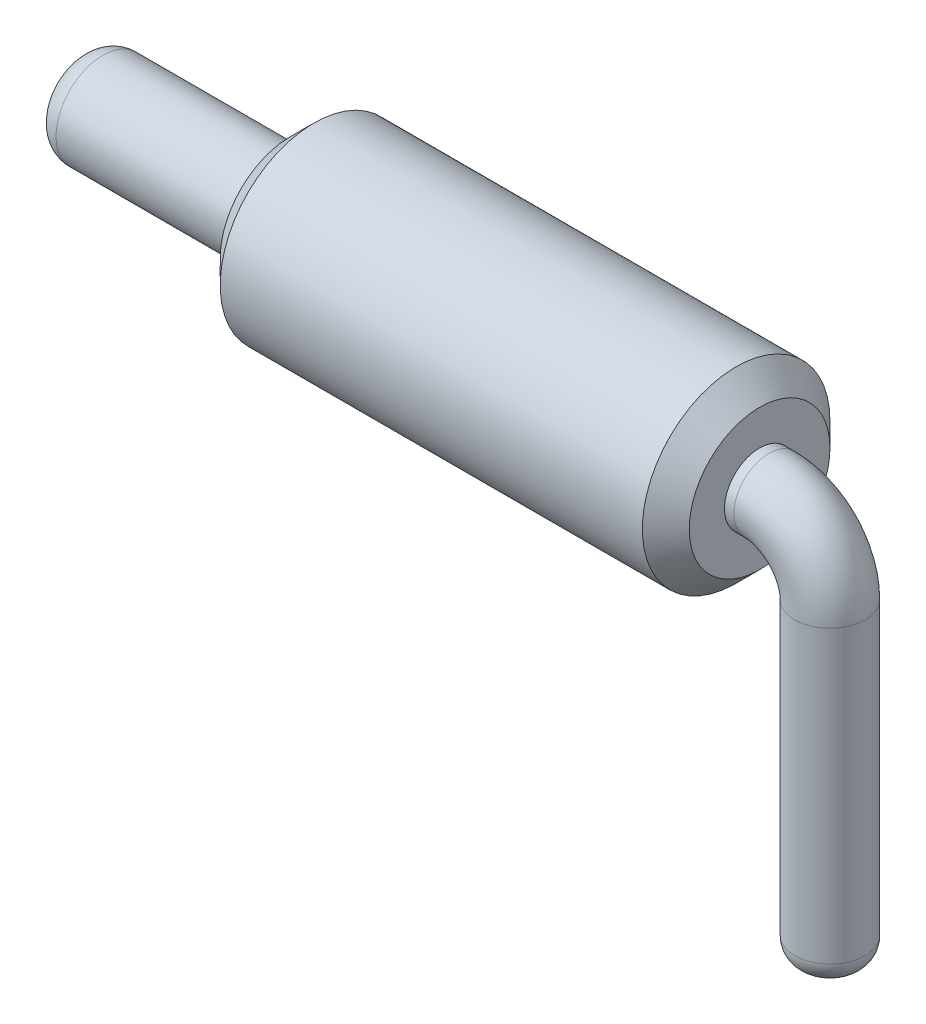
from build123d import *

# Parameters (mm, degrees)
ESQUISSE1_R        = 2
BOSS_EXTRU_1_DEPTH = 10
ESQUISSE2_R        = 1
BOSS_EXTRU_2_DEPTH = 4.5
ESQUISSE4_R        = 0.75
CHANFREIN1_SIZE    = 0.5
CONG_1_R           = 0.5


with BuildPart() as part:
    # Esquisse1 → Boss.-Extru.1 (new body)
    with BuildSketch(Plane(origin=(0, 0, 0), x_dir=(0, 0, -1), z_dir=(1, 0, 0))):
        Circle(ESQUISSE1_R)
    extrude(amount=BOSS_EXTRU_1_DEPTH)

    # Esquisse2 → Boss.-Extru.2 (add)
    with BuildSketch(Plane.ZY):
        with Locations(Location((0, 0, 0), (0, 0, 180))):
            Circle(ESQUISSE2_R)
    extrude(amount=BOSS_EXTRU_2_DEPTH)

    # Balayage1: sweep along a path in Esquisse3
    with BuildLine(Plane.XY) as balayage1_path:
        Line((10, 0), (10.2, 0))
        ThreePointArc((10.2, 0), (11.119238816, -0.380761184), (11.5, -1.3))
        Line((11.5, -1.3), (11.5, -8))
    # Esquisse4 → Balayage1 (sweep)
    with BuildSketch(Plane(origin=(11.5, -8, 0), x_dir=(1, 0, 0), z_dir=(0, -1, 0))):
        Circle(ESQUISSE4_R)
    sweep(path=balayage1_path.line)

    # Chanfrein1
    chanfrein1_edges = [part.edges().sort_by_distance(p)[0] for p in [
        (0, 0, 2),
        (10, 0, 2),
    ]]
    chamfer(chanfrein1_edges, length=CHANFREIN1_SIZE)

    # Cong_1
    cong_1_edges = [part.edges().sort_by_distance(p)[0] for p in [
        (10.75, -8, 0),
        (-4.5, 0, 1),
    ]]
    fillet(cong_1_edges, radius=CONG_1_R)


solid = part.part
